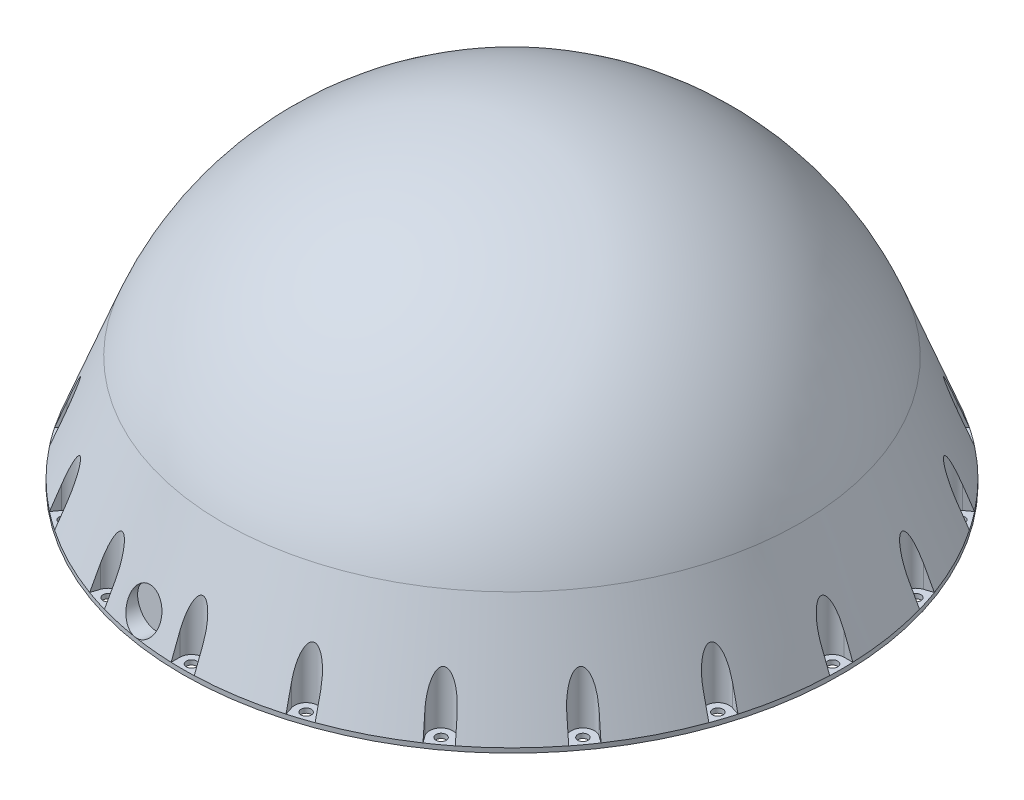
from build123d import *

# Parameters (mm, degrees)
SKETCH2_R          = 2.8067
CUT_EXTRUDE1_DEPTH = 306.778874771
CIRPATTERN1_COUNT  = 20
CUT_EXTRUDE2_DEPTH = 306.778874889
CIRPATTERN2_COUNT  = 20
SKETCH7_R          = 10.5156
CUT_EXTRUDE3_DEPTH = 8.89


with BuildPart() as part:
    # Sketch1 → Revolve1 (revolve)
    with BuildSketch(Plane.XY, mode=Mode.PRIVATE) as revolve1_sk:
        with BuildLine():
            Line((161.544, 0), (180.975, 0))
            Line((180.975, 0), (180.975, 2.54))
            Line((180.975, 2.54), (158.577896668, 60.879549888))
            ThreePointArc((158.577896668, 60.879549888), (96.20841014, 139.990037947), (0, 169.8625))
            Line((0, 169.8625), (0, 165.1))
            ThreePointArc((0, 165.1), (103.99798218, 128.228037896), (161.544, 34.081462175))
            Line((161.544, 34.081462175), (161.544, 0))
        make_face()
    revolve(revolve1_sk.sketch.rotate(Axis((0, 169.8625, 0), (0, -1, 0)), 90), axis=Axis((0, 169.8625, 0), (0, -1, 0)))

    # Sketch2 → Cut-Extrude1 (cut, symmetric)
    with BuildSketch(Plane(origin=(0, 2.54, 0), x_dir=(-1, 0, 0), z_dir=(0, 1, 0))):
        with Locations(Location((176.0728, 0, 0), (0, 0, 90))):
            Circle(SKETCH2_R)
    cut_extrude1 = extrude(amount=CUT_EXTRUDE1_DEPTH, both=True, mode=Mode.SUBTRACT)

    # CirPattern1: Cut-Extrude1 ×20 about axis
    cirpattern1_axis = Axis((0, 0, 0), (0, 1, 0))
    for i in range(1, CIRPATTERN1_COUNT):
        add(cut_extrude1.rotate(cirpattern1_axis, i * 360 / CIRPATTERN1_COUNT), mode=Mode.SUBTRACT)

    # Sketch3 → Cut-Extrude2 (cut, through all)
    with BuildSketch(Plane(origin=(0, 2.54, 0), x_dir=(-1, 0, 0), z_dir=(0, 1, 0))):
        with BuildLine():
            Line((176.0728, 6.35), (184.457769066, 6.35))
            Line((184.457769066, 6.35), (184.457769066, -6.35))
            Line((184.457769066, -6.35), (176.0728, -6.35))
            ThreePointArc((176.0728, -6.35), (169.7228, 0), (176.0728, 6.35))
        make_face()
    cut_extrude2 = extrude(amount=CUT_EXTRUDE2_DEPTH, mode=Mode.SUBTRACT)

    # CirPattern2: Cut-Extrude2 ×20 about axis
    cirpattern2_axis = Axis((0, 0, 0), (0, 1, 0))
    for i in range(1, CIRPATTERN2_COUNT):
        add(cut_extrude2.rotate(cirpattern2_axis, i * 360 / CIRPATTERN2_COUNT), mode=Mode.SUBTRACT)

    # Sketch7 → Cut-Extrude3 (cut)
    with BuildSketch(Plane(origin=(-28.310727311, 0, 178.746897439), x_dir=(0.9876883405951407, 0, 0.1564344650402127), z_dir=(-0.15643446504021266, 0, 0.9876883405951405))):
        with Locations((0, 13.0556)):
            Circle(SKETCH7_R)
    extrude(amount=-CUT_EXTRUDE3_DEPTH, mode=Mode.SUBTRACT)


solid = part.part
